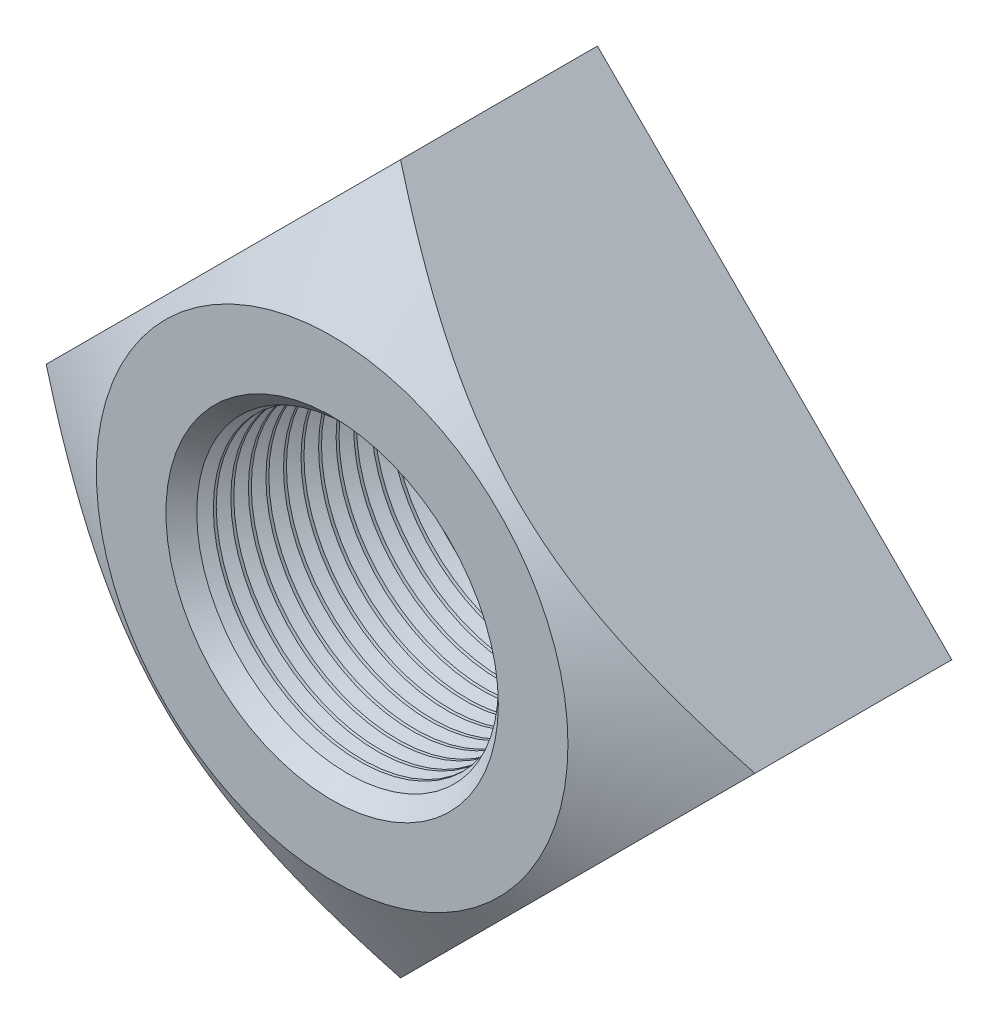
from build123d import *

# Parameters (mm, degrees)
SKETCH1_R        = 9.9175
BASENUT_DEPTH    = 18
CHAMFER1_SIZE    = 1.36
LPATTERN10_COUNT = 13
LPATTERN10_PITCH = 1.1901


with BuildPart() as part:
    # Sketch1 → BaseNut (new body)
    with BuildSketch(Plane.XY):
        Polygon((0, 24.04163056), (-24.04163056, 0), (0, -24.04163056), (24.04163056, 0), align=None)
        Circle(SKETCH1_R, mode=Mode.SUBTRACT)
    extrude(amount=-BASENUT_DEPTH)

    # Sketch2 → Single-Chamfer (revolve, cut)
    with BuildSketch(Plane(origin=(0, 0, 0), x_dir=(-1, 0, 0), z_dir=(0, 1, 0)), mode=Mode.PRIVATE) as single_chamfer_sk:
        Polygon((16, 0), (24.04163056, 0), (24.04163056, -4.642837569), align=None)
    revolve(single_chamfer_sk.sketch.rotate(Axis((0, 0, 6.735803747), (0, 0, -1)), 180.000000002), axis=Axis((0, 0, 6.735803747), (0, 0, -1)), mode=Mode.SUBTRACT)

    # Chamfer1
    chamfer1_edges = [part.edges().sort_by_distance(p)[0] for p in [
        (-9.9175, 0, -18),
        (-9.9175, 0, 0),
    ]]
    chamfer(chamfer1_edges, length=CHAMFER1_SIZE)

    # Sketch3 → Cut-Revolve10 (revolve, cut)
    with BuildSketch(Plane(origin=(0, 0, 0), x_dir=(1, 0, 0), z_dir=(0, 1, 0)), mode=Mode.PRIVATE) as cut_revolve10_sk:
        Polygon((8.92575, 1.855875), (9.9175, 1.855875), (10.776380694, 1.36), (9.9175, 0.864125), (8.92575, 0.864125), align=None)
    cut_revolve10 = revolve(cut_revolve10_sk.sketch.rotate(Axis((0, 0, -25.639638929), (0, 0, 1)), 180), axis=Axis((0, 0, -25.639638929), (0, 0, 1)), mode=Mode.SUBTRACT)

    # LPattern10: Cut-Revolve10 ×13
    with Locations(*[(0, 0, -i * LPATTERN10_PITCH) for i in range(1, LPATTERN10_COUNT)]):
        add(cut_revolve10, mode=Mode.SUBTRACT)


solid = part.part
